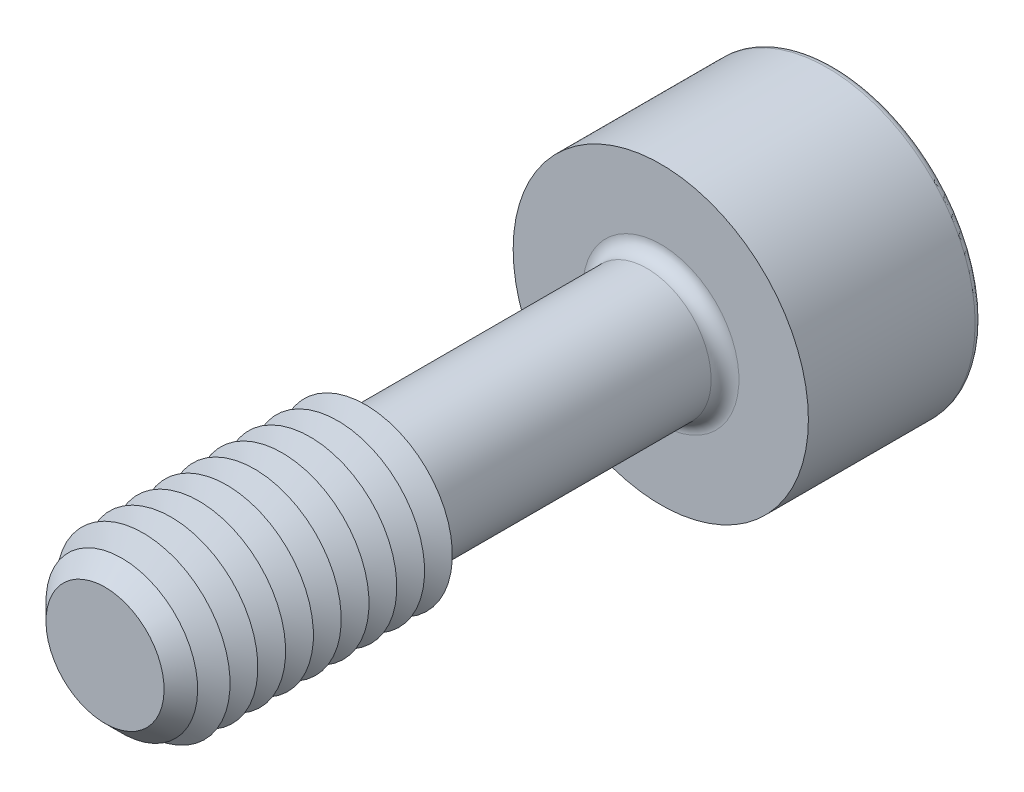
from build123d import *

# Parameters (mm, degrees)
SKETCH1_R       = 1.85
EXTRUDE1_DEPTH  = 8
CHAMFER1_SIZE   = 0.8
SKETCH3_R       = 4.25
EXTRUDE2_DEPTH  = 5
EXTRUDE3_DEPTH  = 4
FILLET1_R       = 0.4
FILLET2_R       = 0.2
LPATTERN1_COUNT = 9
LPATTERN1_PITCH = 0.8


with BuildPart() as part:
    # Sketch1 → Extrude1 (new, symmetric)
    with BuildSketch(Plane.XY):
        Circle(SKETCH1_R)
    extrude(amount=EXTRUDE1_DEPTH, both=True)

    # Sketch2 → Revolve1 (revolve)
    with BuildSketch(Plane(origin=(0, 0, 0), x_dir=(0, 0, -1), z_dir=(1, 0, 0))):
        Polygon((-8, 0), (-8, 2.5), (-0.5, 2.5), (-0.124722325, 1.85), (-0.124722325, 0), align=None)
    revolve(axis=Axis((0, 0, 0.124722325), (0, 0, 1)))

    # Chamfer1
    chamfer1_edges = [part.edges().sort_by_distance(p)[0] for p in [
        (0, -2.5, 8),
    ]]
    chamfer(chamfer1_edges, length=CHAMFER1_SIZE)

    # Sketch3 → Extrude2 (add)
    with BuildSketch(Plane(origin=(0, 0, -8), x_dir=(-1, 0, 0), z_dir=(0, 0, -1))):
        Circle(SKETCH3_R)
    extrude(amount=EXTRUDE2_DEPTH)

    # Sketch4 → Extrude3 (cut)
    with BuildSketch(Plane(origin=(-13.7, 0, -13), x_dir=(1, 0, 0), z_dir=(0, 0, 1))):
        Polygon((12.545299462, -2), (14.854700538, -2), (16.009401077, 0), (14.854700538, 2), (12.545299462, 2), (11.390598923, 0), align=None)
    extrude(amount=EXTRUDE3_DEPTH, mode=Mode.SUBTRACT)

    # Fillet1
    fillet1_edges = [part.edges().sort_by_distance(p)[0] for p in [
        (-1.85, 0, -8),
    ]]
    fillet(fillet1_edges, radius=FILLET1_R)

    # Fillet2
    fillet2_edges = [part.edges().sort_by_distance(p)[0] for p in [
        (4.25, 0, -13),
    ]]
    fillet(fillet2_edges, radius=FILLET2_R)

    # Sketch5 → Cut-Revolve1 (revolve, cut)
    with BuildSketch(Plane(origin=(0, 0, 0), x_dir=(0, 0, -1), z_dir=(1, 0, 0)), mode=Mode.PRIVATE) as cut_revolve1_sk:
        Polygon((9, 0), (9, -2), (7.845299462, 0), align=None)
    revolve(cut_revolve1_sk.sketch.rotate(Axis((0, 0, -7.845299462), (0, 0, -1)), 90), axis=Axis((0, 0, -7.845299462), (0, 0, -1)), mode=Mode.SUBTRACT)

    # Sketch7 → Cut-Revolve2 (revolve, cut)
    with BuildSketch(Plane(origin=(0, 0, 0), x_dir=(0, 0, -1), z_dir=(1, 0, 0)), mode=Mode.PRIVATE) as cut_revolve2_sk:
        Polygon((-0.5, 2.5), (-0.9, 1.807179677), (-1.3, 2.5), align=None)
    cut_revolve2 = revolve(cut_revolve2_sk.sketch.rotate(Axis((0, 0, -1.332048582), (0, 0, 1)), 90), axis=Axis((0, 0, -1.332048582), (0, 0, 1)), mode=Mode.SUBTRACT)

    # LPattern1: Cut-Revolve2 ×9
    with Locations(*[(0, 0, i * LPATTERN1_PITCH) for i in range(1, LPATTERN1_COUNT)]):
        add(cut_revolve2, mode=Mode.SUBTRACT)


solid = part.part
